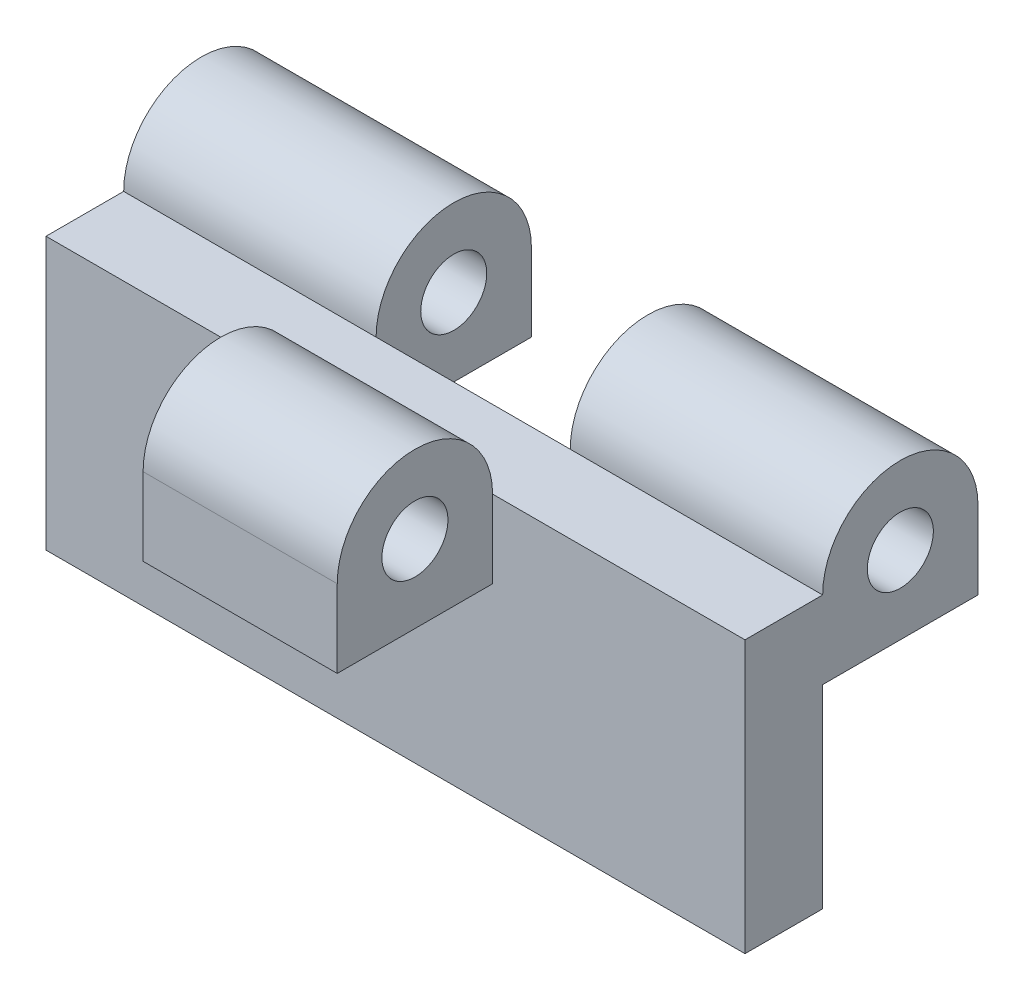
ISO-10303-21;
HEADER;
FILE_DESCRIPTION(('STEP AP214'),'2;1');
FILE_NAME('part.step','',(''),(''),'','','');
FILE_SCHEMA(('AUTOMOTIVE_DESIGN { 1 0 10303 214 1 1 1 1 }'));
ENDSEC;
DATA;
#1=APPLICATION_CONTEXT('core data for automotive mechanical design processes');
#2=APPLICATION_PROTOCOL_DEFINITION('international standard','automotive_design',2000,#1);
#3=PRODUCT_CONTEXT('',#1,'mechanical');
#4=PRODUCT('Part','Part','',(#3));
#5=PRODUCT_RELATED_PRODUCT_CATEGORY('part','',(#4));
#6=PRODUCT_DEFINITION_FORMATION('','',#4);
#7=PRODUCT_DEFINITION_CONTEXT('part definition',#1,'design');
#8=PRODUCT_DEFINITION('design','',#6,#7);
#9=PRODUCT_DEFINITION_SHAPE('','',#8);
#10=(LENGTH_UNIT() NAMED_UNIT(*) SI_UNIT(.MILLI.,.METRE.));
#11=(NAMED_UNIT(*) PLANE_ANGLE_UNIT() SI_UNIT($,.RADIAN.));
#12=(NAMED_UNIT(*) SI_UNIT($,.STERADIAN.) SOLID_ANGLE_UNIT());
#13=UNCERTAINTY_MEASURE_WITH_UNIT(LENGTH_MEASURE(1.E-05),#10,'distance_accuracy_value','');
#14=(GEOMETRIC_REPRESENTATION_CONTEXT(3) GLOBAL_UNCERTAINTY_ASSIGNED_CONTEXT((#13)) GLOBAL_UNIT_ASSIGNED_CONTEXT((#10,
#11,#12)) REPRESENTATION_CONTEXT('',''));
#15=CARTESIAN_POINT('',(0.,0.,0.));
#16=DIRECTION('',(0.,0.,1.));
#17=DIRECTION('',(1.,0.,0.));
#18=AXIS2_PLACEMENT_3D('',#15,#16,#17);
#19=CARTESIAN_POINT('',(0.,0.,0.));
#20=DIRECTION('',(0.,1.,0.));
#21=DIRECTION('',(0.,0.,1.));
#22=AXIS2_PLACEMENT_3D('',#19,#20,#21);
#23=PLANE('',#22);
#24=DIRECTION('',(1.,0.,0.));
#25=VECTOR('',#24,1.);
#26=CARTESIAN_POINT('',(-8.48661728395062,0.,-2.));
#27=LINE('',#26,#25);
#28=CARTESIAN_POINT('',(-26.4866172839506,0.,-2.));
#29=VERTEX_POINT('',#28);
#30=CARTESIAN_POINT('',(-19.9866172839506,0.,-2.));
#31=VERTEX_POINT('',#30);
#32=EDGE_CURVE('E92',#29,#31,#27,.T.);
#33=ORIENTED_EDGE('',*,*,#32,.F.);
#34=DIRECTION('',(0.,0.,1.));
#35=VECTOR('',#34,1.);
#36=CARTESIAN_POINT('',(-26.4866172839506,0.,-6.));
#37=LINE('',#36,#35);
#38=CARTESIAN_POINT('',(-26.4866172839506,0.,-6.));
#39=VERTEX_POINT('',#38);
#40=EDGE_CURVE('E301',#39,#29,#37,.T.);
#41=ORIENTED_EDGE('',*,*,#40,.F.);
#42=DIRECTION('',(-1.,0.,0.));
#43=VECTOR('',#42,1.);
#44=CARTESIAN_POINT('',(-26.4866172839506,0.,-6.));
#45=LINE('',#44,#43);
#46=CARTESIAN_POINT('',(-19.9866172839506,0.,-6.));
#47=VERTEX_POINT('',#46);
#48=EDGE_CURVE('E315',#47,#39,#45,.T.);
#49=ORIENTED_EDGE('',*,*,#48,.F.);
#50=DIRECTION('',(0.,0.,1.));
#51=VECTOR('',#50,1.);
#52=CARTESIAN_POINT('',(-19.9866172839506,0.,-6.));
#53=LINE('',#52,#51);
#54=EDGE_CURVE('E288',#47,#31,#53,.T.);
#55=ORIENTED_EDGE('',*,*,#54,.T.);
#56=EDGE_LOOP('',(#33,#41,#49,#55));
#57=FACE_BOUND('',#56,.T.);
#58=ADVANCED_FACE('F81',(#57),#23,.F.);
#59=CARTESIAN_POINT('',(-14.9866172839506,0.,-2.));
#60=VERTEX_POINT('',#59);
#61=CARTESIAN_POINT('',(-8.48661728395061,0.,-2.));
#62=VERTEX_POINT('',#61);
#63=EDGE_CURVE('E12',#60,#62,#27,.T.);
#64=ORIENTED_EDGE('',*,*,#63,.F.);
#65=DIRECTION('',(0.,0.,-1.));
#66=VECTOR('',#65,1.);
#67=CARTESIAN_POINT('',(-14.9866172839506,0.,-6.));
#68=LINE('',#67,#66);
#69=CARTESIAN_POINT('',(-14.9866172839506,0.,-6.));
#70=VERTEX_POINT('',#69);
#71=EDGE_CURVE('E294',#60,#70,#68,.T.);
#72=ORIENTED_EDGE('',*,*,#71,.T.);
#73=CARTESIAN_POINT('',(-8.48661728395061,0.,-6.));
#74=VERTEX_POINT('',#73);
#75=EDGE_CURVE('E316',#74,#70,#45,.T.);
#76=ORIENTED_EDGE('',*,*,#75,.F.);
#77=DIRECTION('',(0.,0.,-1.));
#78=VECTOR('',#77,1.);
#79=CARTESIAN_POINT('',(-8.48661728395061,0.,-6.));
#80=LINE('',#79,#78);
#81=EDGE_CURVE('E99',#62,#74,#80,.T.);
#82=ORIENTED_EDGE('',*,*,#81,.F.);
#83=EDGE_LOOP('',(#64,#72,#76,#82));
#84=FACE_BOUND('',#83,.T.);
#85=ADVANCED_FACE('F340',(#84),#23,.F.);
#86=DIRECTION('',(-1.,0.,0.));
#87=VECTOR('',#86,1.);
#88=CARTESIAN_POINT('',(-8.48661728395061,0.,0.));
#89=LINE('',#88,#87);
#90=CARTESIAN_POINT('',(-14.9866172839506,0.,0.));
#91=VERTEX_POINT('',#90);
#92=CARTESIAN_POINT('',(-19.9866172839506,0.,0.));
#93=VERTEX_POINT('',#92);
#94=EDGE_CURVE('E90',#91,#93,#89,.T.);
#95=ORIENTED_EDGE('',*,*,#94,.F.);
#96=DIRECTION('',(0.,0.,1.));
#97=VECTOR('',#96,1.);
#98=CARTESIAN_POINT('',(-14.9866172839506,0.,4.));
#99=LINE('',#98,#97);
#100=CARTESIAN_POINT('',(-14.9866172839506,0.,4.));
#101=VERTEX_POINT('',#100);
#102=EDGE_CURVE('E203',#91,#101,#99,.T.);
#103=ORIENTED_EDGE('',*,*,#102,.T.);
#104=DIRECTION('',(1.,0.,0.));
#105=VECTOR('',#104,1.);
#106=CARTESIAN_POINT('',(-26.4866172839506,0.,4.));
#107=LINE('',#106,#105);
#108=CARTESIAN_POINT('',(-19.9866172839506,0.,4.));
#109=VERTEX_POINT('',#108);
#110=EDGE_CURVE('E311',#109,#101,#107,.T.);
#111=ORIENTED_EDGE('',*,*,#110,.F.);
#112=DIRECTION('',(0.,0.,-1.));
#113=VECTOR('',#112,1.);
#114=CARTESIAN_POINT('',(-19.9866172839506,0.,4.));
#115=LINE('',#114,#113);
#116=EDGE_CURVE('E281',#109,#93,#115,.T.);
#117=ORIENTED_EDGE('',*,*,#116,.T.);
#118=EDGE_LOOP('',(#95,#103,#111,#117));
#119=FACE_BOUND('',#118,.T.);
#120=ADVANCED_FACE('F377',(#119),#23,.F.);
#121=CARTESIAN_POINT('',(-26.4866172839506,4.,-6.));
#122=DIRECTION('',(1.,0.,0.));
#123=DIRECTION('',(0.,0.,-1.));
#124=AXIS2_PLACEMENT_3D('',#121,#122,#123);
#125=PLANE('',#124);
#126=CARTESIAN_POINT('',(-26.4866172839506,2.,-4.));
#127=DIRECTION('',(-1.,0.,0.));
#128=DIRECTION('',(0.,0.,1.));
#129=AXIS2_PLACEMENT_3D('',#126,#127,#128);
#130=CIRCLE('',#129,0.85);
#131=CARTESIAN_POINT('',(-26.4866172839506,2.,-3.15));
#132=VERTEX_POINT('',#131);
#133=EDGE_CURVE('E243',#132,#132,#130,.T.);
#134=ORIENTED_EDGE('',*,*,#133,.F.);
#135=EDGE_LOOP('',(#134));
#136=FACE_BOUND('',#135,.T.);
#137=DIRECTION('',(0.,1.,0.));
#138=VECTOR('',#137,1.);
#139=CARTESIAN_POINT('',(-26.4866172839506,0.,0.));
#140=LINE('',#139,#138);
#141=CARTESIAN_POINT('',(-26.4866172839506,-5.,0.));
#142=VERTEX_POINT('',#141);
#143=CARTESIAN_POINT('',(-26.4866172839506,2.,0.));
#144=VERTEX_POINT('',#143);
#145=EDGE_CURVE('E211',#142,#144,#140,.T.);
#146=ORIENTED_EDGE('',*,*,#145,.T.);
#147=DIRECTION('',(0.,0.,1.));
#148=VECTOR('',#147,1.);
#149=CARTESIAN_POINT('',(-26.4866172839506,2.,-2.));
#150=LINE('',#149,#148);
#151=CARTESIAN_POINT('',(-26.4866172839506,2.,-2.));
#152=VERTEX_POINT('',#151);
#153=EDGE_CURVE('E232',#152,#144,#150,.T.);
#154=ORIENTED_EDGE('',*,*,#153,.F.);
#155=CARTESIAN_POINT('',(-26.4866172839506,2.,-4.));
#156=DIRECTION('',(-1.,0.,0.));
#157=DIRECTION('',(0.,0.,1.));
#158=AXIS2_PLACEMENT_3D('',#155,#156,#157);
#159=CIRCLE('',#158,2.);
#160=CARTESIAN_POINT('',(-26.4866172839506,2.,-6.));
#161=VERTEX_POINT('',#160);
#162=EDGE_CURVE('E252',#161,#152,#159,.F.);
#163=ORIENTED_EDGE('',*,*,#162,.F.);
#164=DIRECTION('',(0.,-1.,0.));
#165=VECTOR('',#164,1.);
#166=CARTESIAN_POINT('',(-26.4866172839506,4.,-6.));
#167=LINE('',#166,#165);
#168=EDGE_CURVE('E319',#161,#39,#167,.T.);
#169=ORIENTED_EDGE('',*,*,#168,.T.);
#170=ORIENTED_EDGE('',*,*,#40,.T.);
#171=DIRECTION('',(0.,1.,0.));
#172=VECTOR('',#171,1.);
#173=CARTESIAN_POINT('',(-26.4866172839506,-5.,-2.));
#174=LINE('',#173,#172);
#175=CARTESIAN_POINT('',(-26.4866172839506,-5.,-2.));
#176=VERTEX_POINT('',#175);
#177=EDGE_CURVE('E229',#176,#29,#174,.T.);
#178=ORIENTED_EDGE('',*,*,#177,.F.);
#179=DIRECTION('',(0.,0.,-1.));
#180=VECTOR('',#179,1.);
#181=CARTESIAN_POINT('',(-26.4866172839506,-5.,-2.));
#182=LINE('',#181,#180);
#183=EDGE_CURVE('E214',#142,#176,#182,.T.);
#184=ORIENTED_EDGE('',*,*,#183,.F.);
#185=EDGE_LOOP('',(#146,#154,#163,#169,#170,#178,#184));
#186=FACE_BOUND('',#185,.T.);
#187=ADVANCED_FACE('F83',(#136,#186),#125,.F.);
#188=CARTESIAN_POINT('',(-8.48661728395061,4.,-6.));
#189=DIRECTION('',(-1.,0.,0.));
#190=DIRECTION('',(0.,0.,1.));
#191=AXIS2_PLACEMENT_3D('',#188,#189,#190);
#192=PLANE('',#191);
#193=CARTESIAN_POINT('',(-8.48661728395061,2.,-4.));
#194=DIRECTION('',(-1.,0.,0.));
#195=DIRECTION('',(0.,0.,1.));
#196=AXIS2_PLACEMENT_3D('',#193,#194,#195);
#197=CIRCLE('',#196,0.85);
#198=CARTESIAN_POINT('',(-8.48661728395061,2.,-3.15));
#199=VERTEX_POINT('',#198);
#200=EDGE_CURVE('E249',#199,#199,#197,.T.);
#201=ORIENTED_EDGE('',*,*,#200,.T.);
#202=EDGE_LOOP('',(#201));
#203=FACE_BOUND('',#202,.T.);
#204=CARTESIAN_POINT('',(-8.48661728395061,2.,-4.));
#205=DIRECTION('',(-1.,0.,0.));
#206=DIRECTION('',(0.,0.,1.));
#207=AXIS2_PLACEMENT_3D('',#204,#205,#206);
#208=CIRCLE('',#207,2.);
#209=CARTESIAN_POINT('',(-8.48661728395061,2.,-6.));
#210=VERTEX_POINT('',#209);
#211=CARTESIAN_POINT('',(-8.48661728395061,2.,-2.));
#212=VERTEX_POINT('',#211);
#213=EDGE_CURVE('E261',#210,#212,#208,.F.);
#214=ORIENTED_EDGE('',*,*,#213,.T.);
#215=DIRECTION('',(0.,0.,1.));
#216=VECTOR('',#215,1.);
#217=CARTESIAN_POINT('',(-8.48661728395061,2.,-6.));
#218=LINE('',#217,#216);
#219=CARTESIAN_POINT('',(-8.48661728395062,2.,0.));
#220=VERTEX_POINT('',#219);
#221=EDGE_CURVE('E199',#212,#220,#218,.T.);
#222=ORIENTED_EDGE('',*,*,#221,.T.);
#223=DIRECTION('',(0.,1.,0.));
#224=VECTOR('',#223,1.);
#225=CARTESIAN_POINT('',(-8.48661728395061,0.,0.));
#226=LINE('',#225,#224);
#227=CARTESIAN_POINT('',(-8.48661728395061,-5.,0.));
#228=VERTEX_POINT('',#227);
#229=EDGE_CURVE('E192',#228,#220,#226,.T.);
#230=ORIENTED_EDGE('',*,*,#229,.F.);
#231=DIRECTION('',(0.,0.,1.));
#232=VECTOR('',#231,1.);
#233=CARTESIAN_POINT('',(-8.48661728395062,-5.,-2.));
#234=LINE('',#233,#232);
#235=CARTESIAN_POINT('',(-8.48661728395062,-5.,-2.));
#236=VERTEX_POINT('',#235);
#237=EDGE_CURVE('E198',#236,#228,#234,.T.);
#238=ORIENTED_EDGE('',*,*,#237,.F.);
#239=DIRECTION('',(0.,1.,0.));
#240=VECTOR('',#239,1.);
#241=CARTESIAN_POINT('',(-8.48661728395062,-5.,-2.));
#242=LINE('',#241,#240);
#243=EDGE_CURVE('E224',#236,#62,#242,.T.);
#244=ORIENTED_EDGE('',*,*,#243,.T.);
#245=ORIENTED_EDGE('',*,*,#81,.T.);
#246=DIRECTION('',(0.,-1.,0.));
#247=VECTOR('',#246,1.);
#248=CARTESIAN_POINT('',(-8.48661728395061,4.,-6.));
#249=LINE('',#248,#247);
#250=EDGE_CURVE('E321',#210,#74,#249,.T.);
#251=ORIENTED_EDGE('',*,*,#250,.F.);
#252=EDGE_LOOP('',(#214,#222,#230,#238,#244,#245,#251));
#253=FACE_BOUND('',#252,.T.);
#254=ADVANCED_FACE('F195',(#203,#253),#192,.F.);
#255=CARTESIAN_POINT('',(-19.9866172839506,0.,-6.));
#256=DIRECTION('',(-1.,0.,0.));
#257=DIRECTION('',(0.,0.,1.));
#258=AXIS2_PLACEMENT_3D('',#255,#256,#257);
#259=PLANE('',#258);
#260=CARTESIAN_POINT('',(-19.9866172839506,2.,-4.));
#261=DIRECTION('',(-1.,0.,0.));
#262=DIRECTION('',(0.,0.,1.));
#263=AXIS2_PLACEMENT_3D('',#260,#261,#262);
#264=CIRCLE('',#263,0.85);
#265=CARTESIAN_POINT('',(-19.9866172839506,2.,-3.15));
#266=VERTEX_POINT('',#265);
#267=EDGE_CURVE('E246',#266,#266,#264,.T.);
#268=ORIENTED_EDGE('',*,*,#267,.T.);
#269=EDGE_LOOP('',(#268));
#270=FACE_BOUND('',#269,.T.);
#271=CARTESIAN_POINT('',(-19.9866172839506,2.,-4.));
#272=DIRECTION('',(-1.,0.,0.));
#273=DIRECTION('',(0.,0.,1.));
#274=AXIS2_PLACEMENT_3D('',#271,#272,#273);
#275=CIRCLE('',#274,2.);
#276=CARTESIAN_POINT('',(-19.9866172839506,2.,-6.));
#277=VERTEX_POINT('',#276);
#278=CARTESIAN_POINT('',(-19.9866172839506,2.,-2.));
#279=VERTEX_POINT('',#278);
#280=EDGE_CURVE('E258',#277,#279,#275,.F.);
#281=ORIENTED_EDGE('',*,*,#280,.T.);
#282=DIRECTION('',(0.,1.,0.));
#283=VECTOR('',#282,1.);
#284=CARTESIAN_POINT('',(-19.9866172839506,0.,-2.));
#285=LINE('',#284,#283);
#286=EDGE_CURVE('E297',#31,#279,#285,.T.);
#287=ORIENTED_EDGE('',*,*,#286,.F.);
#288=ORIENTED_EDGE('',*,*,#54,.F.);
#289=DIRECTION('',(0.,1.,0.));
#290=VECTOR('',#289,1.);
#291=CARTESIAN_POINT('',(-19.9866172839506,0.,-6.));
#292=LINE('',#291,#290);
#293=EDGE_CURVE('E298',#47,#277,#292,.T.);
#294=ORIENTED_EDGE('',*,*,#293,.T.);
#295=EDGE_LOOP('',(#281,#287,#288,#294));
#296=FACE_BOUND('',#295,.T.);
#297=ADVANCED_FACE('F349',(#270,#296),#259,.F.);
#298=CARTESIAN_POINT('',(-14.9866172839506,0.,-6.));
#299=DIRECTION('',(1.,0.,0.));
#300=DIRECTION('',(0.,0.,-1.));
#301=AXIS2_PLACEMENT_3D('',#298,#299,#300);
#302=PLANE('',#301);
#303=CARTESIAN_POINT('',(-14.9866172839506,2.,-4.));
#304=DIRECTION('',(1.,0.,0.));
#305=DIRECTION('',(0.,0.,-1.));
#306=AXIS2_PLACEMENT_3D('',#303,#304,#305);
#307=CIRCLE('',#306,0.85);
#308=CARTESIAN_POINT('',(-14.9866172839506,2.,-4.85));
#309=VERTEX_POINT('',#308);
#310=EDGE_CURVE('E85',#309,#309,#307,.T.);
#311=ORIENTED_EDGE('',*,*,#310,.T.);
#312=EDGE_LOOP('',(#311));
#313=FACE_BOUND('',#312,.T.);
#314=DIRECTION('',(0.,1.,0.));
#315=VECTOR('',#314,1.);
#316=CARTESIAN_POINT('',(-14.9866172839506,0.,-2.));
#317=LINE('',#316,#315);
#318=CARTESIAN_POINT('',(-14.9866172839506,2.,-2.));
#319=VERTEX_POINT('',#318);
#320=EDGE_CURVE('E305',#60,#319,#317,.T.);
#321=ORIENTED_EDGE('',*,*,#320,.T.);
#322=CARTESIAN_POINT('',(-14.9866172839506,2.,-4.));
#323=DIRECTION('',(1.,0.,0.));
#324=DIRECTION('',(0.,0.,-1.));
#325=AXIS2_PLACEMENT_3D('',#322,#323,#324);
#326=CIRCLE('',#325,2.);
#327=CARTESIAN_POINT('',(-14.9866172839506,2.,-6.));
#328=VERTEX_POINT('',#327);
#329=EDGE_CURVE('E226',#319,#328,#326,.F.);
#330=ORIENTED_EDGE('',*,*,#329,.T.);
#331=DIRECTION('',(0.,1.,0.));
#332=VECTOR('',#331,1.);
#333=CARTESIAN_POINT('',(-14.9866172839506,0.,-6.));
#334=LINE('',#333,#332);
#335=EDGE_CURVE('E302',#70,#328,#334,.T.);
#336=ORIENTED_EDGE('',*,*,#335,.F.);
#337=ORIENTED_EDGE('',*,*,#71,.F.);
#338=EDGE_LOOP('',(#321,#330,#336,#337));
#339=FACE_BOUND('',#338,.T.);
#340=ADVANCED_FACE('F331',(#313,#339),#302,.F.);
#341=CARTESIAN_POINT('',(-19.9866172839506,0.,4.));
#342=DIRECTION('',(1.,0.,0.));
#343=DIRECTION('',(0.,0.,-1.));
#344=AXIS2_PLACEMENT_3D('',#341,#342,#343);
#345=PLANE('',#344);
#346=CARTESIAN_POINT('',(-19.9866172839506,2.,1.99999999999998));
#347=DIRECTION('',(-1.,0.,0.));
#348=DIRECTION('',(0.,0.,1.));
#349=AXIS2_PLACEMENT_3D('',#346,#347,#348);
#350=CIRCLE('',#349,0.85);
#351=CARTESIAN_POINT('',(-19.9866172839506,2.,2.84999999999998));
#352=VERTEX_POINT('',#351);
#353=EDGE_CURVE('E263',#352,#352,#350,.T.);
#354=ORIENTED_EDGE('',*,*,#353,.F.);
#355=EDGE_LOOP('',(#354));
#356=FACE_BOUND('',#355,.T.);
#357=DIRECTION('',(0.,1.,0.));
#358=VECTOR('',#357,1.);
#359=CARTESIAN_POINT('',(-19.9866172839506,0.,4.));
#360=LINE('',#359,#358);
#361=CARTESIAN_POINT('',(-19.9866172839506,2.,4.));
#362=VERTEX_POINT('',#361);
#363=EDGE_CURVE('E286',#109,#362,#360,.T.);
#364=ORIENTED_EDGE('',*,*,#363,.T.);
#365=CARTESIAN_POINT('',(-19.9866172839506,2.,2.));
#366=DIRECTION('',(-1.,0.,0.));
#367=DIRECTION('',(0.,0.,1.));
#368=AXIS2_PLACEMENT_3D('',#365,#366,#367);
#369=CIRCLE('',#368,2.);
#370=CARTESIAN_POINT('',(-19.9866172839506,2.,0.));
#371=VERTEX_POINT('',#370);
#372=EDGE_CURVE('E267',#362,#371,#369,.T.);
#373=ORIENTED_EDGE('',*,*,#372,.T.);
#374=DIRECTION('',(0.,1.,0.));
#375=VECTOR('',#374,1.);
#376=CARTESIAN_POINT('',(-19.9866172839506,0.,0.));
#377=LINE('',#376,#375);
#378=EDGE_CURVE('E289',#93,#371,#377,.T.);
#379=ORIENTED_EDGE('',*,*,#378,.F.);
#380=ORIENTED_EDGE('',*,*,#116,.F.);
#381=EDGE_LOOP('',(#364,#373,#379,#380));
#382=FACE_BOUND('',#381,.T.);
#383=ADVANCED_FACE('F400',(#356,#382),#345,.F.);
#384=CARTESIAN_POINT('',(-14.9866172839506,0.,4.));
#385=DIRECTION('',(-1.,0.,0.));
#386=DIRECTION('',(0.,0.,1.));
#387=AXIS2_PLACEMENT_3D('',#384,#385,#386);
#388=PLANE('',#387);
#389=CARTESIAN_POINT('',(-14.9866172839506,2.,1.99999999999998));
#390=DIRECTION('',(-1.,0.,0.));
#391=DIRECTION('',(0.,0.,1.));
#392=AXIS2_PLACEMENT_3D('',#389,#390,#391);
#393=CIRCLE('',#392,0.85);
#394=CARTESIAN_POINT('',(-14.9866172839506,2.,2.84999999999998));
#395=VERTEX_POINT('',#394);
#396=EDGE_CURVE('E266',#395,#395,#393,.T.);
#397=ORIENTED_EDGE('',*,*,#396,.T.);
#398=EDGE_LOOP('',(#397));
#399=FACE_BOUND('',#398,.T.);
#400=CARTESIAN_POINT('',(-14.9866172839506,2.,2.));
#401=DIRECTION('',(-1.,0.,0.));
#402=DIRECTION('',(0.,0.,1.));
#403=AXIS2_PLACEMENT_3D('',#400,#401,#402);
#404=CIRCLE('',#403,2.);
#405=CARTESIAN_POINT('',(-14.9866172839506,2.,4.));
#406=VERTEX_POINT('',#405);
#407=CARTESIAN_POINT('',(-14.9866172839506,2.,0.));
#408=VERTEX_POINT('',#407);
#409=EDGE_CURVE('E273',#406,#408,#404,.T.);
#410=ORIENTED_EDGE('',*,*,#409,.F.);
#411=DIRECTION('',(0.,1.,0.));
#412=VECTOR('',#411,1.);
#413=CARTESIAN_POINT('',(-14.9866172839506,0.,4.));
#414=LINE('',#413,#412);
#415=EDGE_CURVE('E278',#101,#406,#414,.T.);
#416=ORIENTED_EDGE('',*,*,#415,.F.);
#417=ORIENTED_EDGE('',*,*,#102,.F.);
#418=DIRECTION('',(0.,1.,0.));
#419=VECTOR('',#418,1.);
#420=CARTESIAN_POINT('',(-14.9866172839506,0.,0.));
#421=LINE('',#420,#419);
#422=EDGE_CURVE('E202',#91,#408,#421,.T.);
#423=ORIENTED_EDGE('',*,*,#422,.T.);
#424=EDGE_LOOP('',(#410,#416,#417,#423));
#425=FACE_BOUND('',#424,.T.);
#426=ADVANCED_FACE('F393',(#399,#425),#388,.F.);
#427=CARTESIAN_POINT('',(-26.4866172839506,4.,-6.));
#428=DIRECTION('',(0.,0.,1.));
#429=DIRECTION('',(1.,0.,0.));
#430=AXIS2_PLACEMENT_3D('',#427,#428,#429);
#431=PLANE('',#430);
#432=ORIENTED_EDGE('',*,*,#168,.F.);
#433=DIRECTION('',(-1.,0.,0.));
#434=VECTOR('',#433,1.);
#435=CARTESIAN_POINT('',(-6.48661728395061,2.,-6.));
#436=LINE('',#435,#434);
#437=EDGE_CURVE('E255',#277,#161,#436,.T.);
#438=ORIENTED_EDGE('',*,*,#437,.F.);
#439=ORIENTED_EDGE('',*,*,#293,.F.);
#440=ORIENTED_EDGE('',*,*,#48,.T.);
#441=EDGE_LOOP('',(#432,#438,#439,#440));
#442=FACE_BOUND('',#441,.T.);
#443=ADVANCED_FACE('F359',(#442),#431,.F.);
#444=CARTESIAN_POINT('',(-26.4866172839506,4.,4.));
#445=DIRECTION('',(0.,0.,-1.));
#446=DIRECTION('',(-1.,0.,0.));
#447=AXIS2_PLACEMENT_3D('',#444,#445,#446);
#448=PLANE('',#447);
#449=ORIENTED_EDGE('',*,*,#415,.T.);
#450=DIRECTION('',(-1.,0.,0.));
#451=VECTOR('',#450,1.);
#452=CARTESIAN_POINT('',(0.0133827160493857,2.,4.));
#453=LINE('',#452,#451);
#454=EDGE_CURVE('E324',#406,#362,#453,.T.);
#455=ORIENTED_EDGE('',*,*,#454,.T.);
#456=ORIENTED_EDGE('',*,*,#363,.F.);
#457=ORIENTED_EDGE('',*,*,#110,.T.);
#458=EDGE_LOOP('',(#449,#455,#456,#457));
#459=FACE_BOUND('',#458,.T.);
#460=ADVANCED_FACE('F398',(#459),#448,.F.);
#461=ORIENTED_EDGE('',*,*,#335,.T.);
#462=EDGE_CURVE('E257',#210,#328,#436,.T.);
#463=ORIENTED_EDGE('',*,*,#462,.F.);
#464=ORIENTED_EDGE('',*,*,#250,.T.);
#465=ORIENTED_EDGE('',*,*,#75,.T.);
#466=EDGE_LOOP('',(#461,#463,#464,#465));
#467=FACE_BOUND('',#466,.T.);
#468=ADVANCED_FACE('F338',(#467),#431,.F.);
#469=CARTESIAN_POINT('',(-19.9866172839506,0.,-2.));
#470=DIRECTION('',(0.,0.,1.));
#471=DIRECTION('',(1.,0.,0.));
#472=AXIS2_PLACEMENT_3D('',#469,#470,#471);
#473=PLANE('',#472);
#474=ORIENTED_EDGE('',*,*,#286,.T.);
#475=DIRECTION('',(-1.,0.,0.));
#476=VECTOR('',#475,1.);
#477=CARTESIAN_POINT('',(-6.48661728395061,2.,-2.));
#478=LINE('',#477,#476);
#479=EDGE_CURVE('E234',#319,#279,#478,.T.);
#480=ORIENTED_EDGE('',*,*,#479,.F.);
#481=ORIENTED_EDGE('',*,*,#320,.F.);
#482=ORIENTED_EDGE('',*,*,#63,.T.);
#483=ORIENTED_EDGE('',*,*,#243,.F.);
#484=DIRECTION('',(1.,0.,0.));
#485=VECTOR('',#484,1.);
#486=CARTESIAN_POINT('',(-8.48661728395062,-5.,-2.));
#487=LINE('',#486,#485);
#488=EDGE_CURVE('E218',#176,#236,#487,.T.);
#489=ORIENTED_EDGE('',*,*,#488,.F.);
#490=ORIENTED_EDGE('',*,*,#177,.T.);
#491=ORIENTED_EDGE('',*,*,#32,.T.);
#492=EDGE_LOOP('',(#474,#480,#481,#482,#483,#489,#490,#491));
#493=FACE_BOUND('',#492,.T.);
#494=ADVANCED_FACE('F343',(#493),#473,.F.);
#495=CARTESIAN_POINT('',(-26.4866172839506,0.,0.));
#496=DIRECTION('',(0.,0.,-1.));
#497=DIRECTION('',(-1.,0.,0.));
#498=AXIS2_PLACEMENT_3D('',#495,#496,#497);
#499=PLANE('',#498);
#500=ORIENTED_EDGE('',*,*,#378,.T.);
#501=DIRECTION('',(-1.,0.,0.));
#502=VECTOR('',#501,1.);
#503=CARTESIAN_POINT('',(-6.48661728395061,2.,0.));
#504=LINE('',#503,#502);
#505=EDGE_CURVE('E235',#371,#144,#504,.T.);
#506=ORIENTED_EDGE('',*,*,#505,.T.);
#507=ORIENTED_EDGE('',*,*,#145,.F.);
#508=DIRECTION('',(-1.,0.,0.));
#509=VECTOR('',#508,1.);
#510=CARTESIAN_POINT('',(-8.48661728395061,-5.,0.));
#511=LINE('',#510,#509);
#512=EDGE_CURVE('E206',#228,#142,#511,.T.);
#513=ORIENTED_EDGE('',*,*,#512,.F.);
#514=ORIENTED_EDGE('',*,*,#229,.T.);
#515=EDGE_CURVE('E237',#220,#408,#504,.T.);
#516=ORIENTED_EDGE('',*,*,#515,.T.);
#517=ORIENTED_EDGE('',*,*,#422,.F.);
#518=ORIENTED_EDGE('',*,*,#94,.T.);
#519=EDGE_LOOP('',(#500,#506,#507,#513,#514,#516,#517,#518));
#520=FACE_BOUND('',#519,.T.);
#521=ADVANCED_FACE('F208',(#520),#499,.F.);
#522=CARTESIAN_POINT('',(0.0133827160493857,2.,2.));
#523=DIRECTION('',(-1.,0.,0.));
#524=DIRECTION('',(0.,0.,1.));
#525=AXIS2_PLACEMENT_3D('',#522,#523,#524);
#526=CYLINDRICAL_SURFACE('',#525,2.);
#527=ORIENTED_EDGE('',*,*,#409,.T.);
#528=DIRECTION('',(-1.,0.,0.));
#529=VECTOR('',#528,1.);
#530=CARTESIAN_POINT('',(0.0133827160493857,2.,0.));
#531=LINE('',#530,#529);
#532=EDGE_CURVE('E270',#408,#371,#531,.T.);
#533=ORIENTED_EDGE('',*,*,#532,.T.);
#534=ORIENTED_EDGE('',*,*,#372,.F.);
#535=ORIENTED_EDGE('',*,*,#454,.F.);
#536=EDGE_LOOP('',(#527,#533,#534,#535));
#537=FACE_BOUND('',#536,.T.);
#538=ADVANCED_FACE('F371',(#537),#526,.T.);
#539=CARTESIAN_POINT('',(0.0133827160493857,2.,1.99999999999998));
#540=DIRECTION('',(-1.,0.,0.));
#541=DIRECTION('',(0.,0.,1.));
#542=AXIS2_PLACEMENT_3D('',#539,#540,#541);
#543=CYLINDRICAL_SURFACE('',#542,0.85);
#544=ORIENTED_EDGE('',*,*,#353,.T.);
#545=EDGE_LOOP('',(#544));
#546=FACE_BOUND('',#545,.T.);
#547=ORIENTED_EDGE('',*,*,#396,.F.);
#548=EDGE_LOOP('',(#547));
#549=FACE_BOUND('',#548,.T.);
#550=ADVANCED_FACE('F364',(#546,#549),#543,.F.);
#551=CARTESIAN_POINT('',(-6.48661728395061,2.,-4.));
#552=DIRECTION('',(-1.,0.,0.));
#553=DIRECTION('',(0.,0.,1.));
#554=AXIS2_PLACEMENT_3D('',#551,#552,#553);
#555=CYLINDRICAL_SURFACE('',#554,2.);
#556=ORIENTED_EDGE('',*,*,#462,.T.);
#557=ORIENTED_EDGE('',*,*,#329,.F.);
#558=DIRECTION('',(-1.,0.,0.));
#559=VECTOR('',#558,1.);
#560=CARTESIAN_POINT('',(-6.48661728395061,2.,-2.));
#561=LINE('',#560,#559);
#562=EDGE_CURVE('E242',#212,#319,#561,.T.);
#563=ORIENTED_EDGE('',*,*,#562,.F.);
#564=ORIENTED_EDGE('',*,*,#213,.F.);
#565=EDGE_LOOP('',(#556,#557,#563,#564));
#566=FACE_BOUND('',#565,.T.);
#567=ADVANCED_FACE('F362',(#566),#555,.T.);
#568=ORIENTED_EDGE('',*,*,#437,.T.);
#569=ORIENTED_EDGE('',*,*,#162,.T.);
#570=EDGE_CURVE('E240',#279,#152,#561,.T.);
#571=ORIENTED_EDGE('',*,*,#570,.F.);
#572=ORIENTED_EDGE('',*,*,#280,.F.);
#573=EDGE_LOOP('',(#568,#569,#571,#572));
#574=FACE_BOUND('',#573,.T.);
#575=ADVANCED_FACE('F353',(#574),#555,.T.);
#576=CARTESIAN_POINT('',(-6.48661728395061,2.,-4.));
#577=DIRECTION('',(-1.,0.,0.));
#578=DIRECTION('',(0.,0.,1.));
#579=AXIS2_PLACEMENT_3D('',#576,#577,#578);
#580=CYLINDRICAL_SURFACE('',#579,0.85);
#581=ORIENTED_EDGE('',*,*,#310,.F.);
#582=EDGE_LOOP('',(#581));
#583=FACE_BOUND('',#582,.T.);
#584=ORIENTED_EDGE('',*,*,#200,.F.);
#585=EDGE_LOOP('',(#584));
#586=FACE_BOUND('',#585,.T.);
#587=ADVANCED_FACE('F370',(#583,#586),#580,.F.);
#588=ORIENTED_EDGE('',*,*,#133,.T.);
#589=EDGE_LOOP('',(#588));
#590=FACE_BOUND('',#589,.T.);
#591=ORIENTED_EDGE('',*,*,#267,.F.);
#592=EDGE_LOOP('',(#591));
#593=FACE_BOUND('',#592,.T.);
#594=ADVANCED_FACE('F425',(#590,#593),#580,.F.);
#595=CARTESIAN_POINT('',(-6.48661728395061,2.,-2.));
#596=DIRECTION('',(0.,-1.,0.));
#597=DIRECTION('',(0.,0.,-1.));
#598=AXIS2_PLACEMENT_3D('',#595,#596,#597);
#599=PLANE('',#598);
#600=ORIENTED_EDGE('',*,*,#562,.T.);
#601=ORIENTED_EDGE('',*,*,#479,.T.);
#602=ORIENTED_EDGE('',*,*,#570,.T.);
#603=ORIENTED_EDGE('',*,*,#153,.T.);
#604=ORIENTED_EDGE('',*,*,#505,.F.);
#605=ORIENTED_EDGE('',*,*,#532,.F.);
#606=ORIENTED_EDGE('',*,*,#515,.F.);
#607=ORIENTED_EDGE('',*,*,#221,.F.);
#608=EDGE_LOOP('',(#600,#601,#602,#603,#604,#605,#606,#607));
#609=FACE_BOUND('',#608,.T.);
#610=ADVANCED_FACE('F345',(#609),#599,.F.);
#611=CARTESIAN_POINT('',(0.,-5.,0.));
#612=DIRECTION('',(0.,-1.,0.));
#613=DIRECTION('',(0.,0.,-1.));
#614=AXIS2_PLACEMENT_3D('',#611,#612,#613);
#615=PLANE('',#614);
#616=ORIENTED_EDGE('',*,*,#237,.T.);
#617=ORIENTED_EDGE('',*,*,#512,.T.);
#618=ORIENTED_EDGE('',*,*,#183,.T.);
#619=ORIENTED_EDGE('',*,*,#488,.T.);
#620=EDGE_LOOP('',(#616,#617,#618,#619));
#621=FACE_BOUND('',#620,.T.);
#622=ADVANCED_FACE('F216',(#621),#615,.T.);
#623=CLOSED_SHELL('',(#58,#85,#120,#187,#254,#297,#340,#383,#426,#443,#460,#468,#494,#521,#538,
#550,#567,#575,#587,#594,#610,#622));
#624=MANIFOLD_SOLID_BREP('B2',#623);
#625=ADVANCED_BREP_SHAPE_REPRESENTATION('',(#18,#624),#14);
#626=SHAPE_DEFINITION_REPRESENTATION(#9,#625);
ENDSEC;
END-ISO-10303-21;
